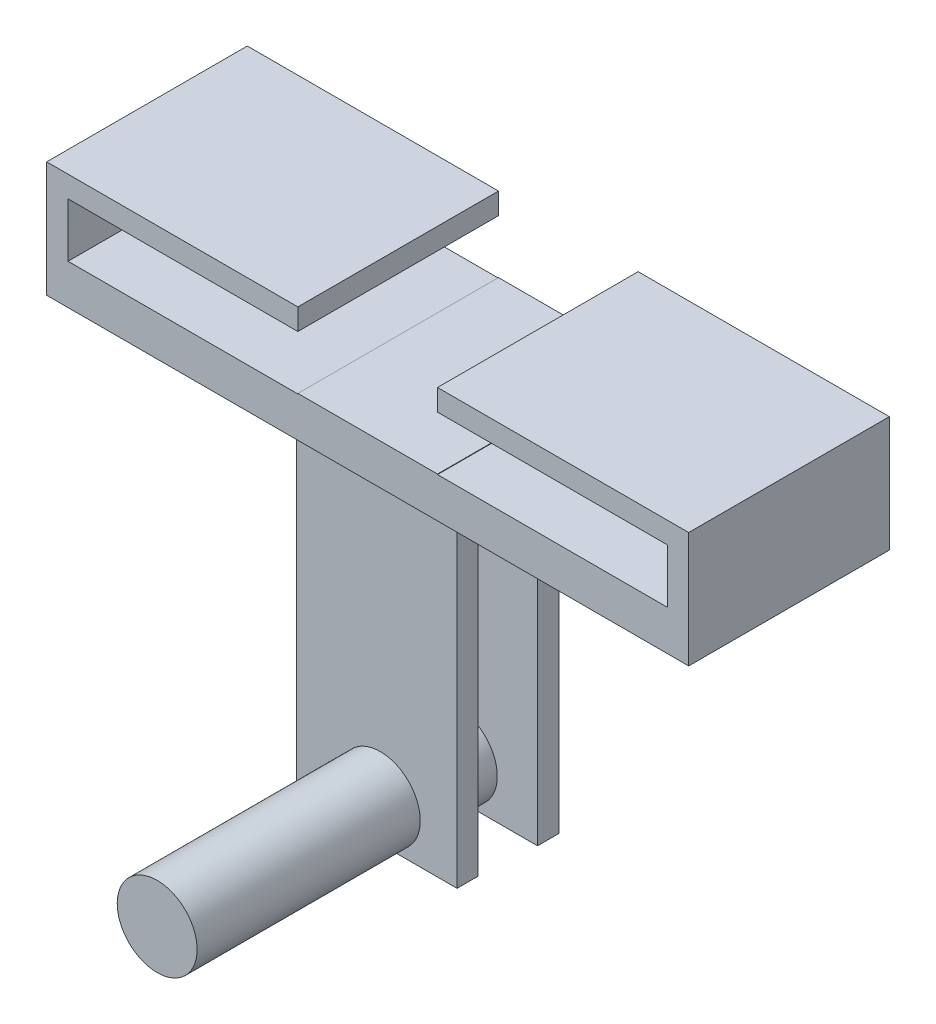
ISO-10303-21;
HEADER;
FILE_DESCRIPTION(('STEP AP214'),'2;1');
FILE_NAME('part.step','',(''),(''),'','','');
FILE_SCHEMA(('AUTOMOTIVE_DESIGN { 1 0 10303 214 1 1 1 1 }'));
ENDSEC;
DATA;
#1=APPLICATION_CONTEXT('core data for automotive mechanical design processes');
#2=APPLICATION_PROTOCOL_DEFINITION('international standard','automotive_design',2000,#1);
#3=PRODUCT_CONTEXT('',#1,'mechanical');
#4=PRODUCT('Part','Part','',(#3));
#5=PRODUCT_RELATED_PRODUCT_CATEGORY('part','',(#4));
#6=PRODUCT_DEFINITION_FORMATION('','',#4);
#7=PRODUCT_DEFINITION_CONTEXT('part definition',#1,'design');
#8=PRODUCT_DEFINITION('design','',#6,#7);
#9=PRODUCT_DEFINITION_SHAPE('','',#8);
#10=(LENGTH_UNIT() NAMED_UNIT(*) SI_UNIT(.MILLI.,.METRE.));
#11=(NAMED_UNIT(*) PLANE_ANGLE_UNIT() SI_UNIT($,.RADIAN.));
#12=(NAMED_UNIT(*) SI_UNIT($,.STERADIAN.) SOLID_ANGLE_UNIT());
#13=UNCERTAINTY_MEASURE_WITH_UNIT(LENGTH_MEASURE(1.E-05),#10,'distance_accuracy_value','');
#14=(GEOMETRIC_REPRESENTATION_CONTEXT(3) GLOBAL_UNCERTAINTY_ASSIGNED_CONTEXT((#13)) GLOBAL_UNIT_ASSIGNED_CONTEXT((#10,
#11,#12)) REPRESENTATION_CONTEXT('',''));
#15=CARTESIAN_POINT('',(0.,0.,0.));
#16=DIRECTION('',(0.,0.,1.));
#17=DIRECTION('',(1.,0.,0.));
#18=AXIS2_PLACEMENT_3D('',#15,#16,#17);
#19=CARTESIAN_POINT('',(0.,0.,0.));
#20=DIRECTION('',(0.,-1.,0.));
#21=DIRECTION('',(0.,0.,-1.));
#22=AXIS2_PLACEMENT_3D('',#19,#20,#21);
#23=PLANE('',#22);
#24=DIRECTION('',(0.,0.,-1.));
#25=VECTOR('',#24,1.);
#26=CARTESIAN_POINT('',(0.,0.,0.));
#27=LINE('',#26,#25);
#28=CARTESIAN_POINT('',(0.,0.,0.));
#29=VERTEX_POINT('',#28);
#30=CARTESIAN_POINT('',(0.,0.,-31.75));
#31=VERTEX_POINT('',#30);
#32=EDGE_CURVE('E357',#29,#31,#27,.T.);
#33=ORIENTED_EDGE('',*,*,#32,.T.);
#34=DIRECTION('',(1.,0.,0.));
#35=VECTOR('',#34,1.);
#36=CARTESIAN_POINT('',(0.,0.,-31.75));
#37=LINE('',#36,#35);
#38=CARTESIAN_POINT('',(101.6,0.,-31.75));
#39=VERTEX_POINT('',#38);
#40=EDGE_CURVE('E381',#31,#39,#37,.T.);
#41=ORIENTED_EDGE('',*,*,#40,.T.);
#42=DIRECTION('',(0.,0.,-1.));
#43=VECTOR('',#42,1.);
#44=CARTESIAN_POINT('',(101.6,0.,0.));
#45=LINE('',#44,#43);
#46=CARTESIAN_POINT('',(101.6,0.,0.));
#47=VERTEX_POINT('',#46);
#48=EDGE_CURVE('E384',#47,#39,#45,.T.);
#49=ORIENTED_EDGE('',*,*,#48,.F.);
#50=DIRECTION('',(1.,0.,0.));
#51=VECTOR('',#50,1.);
#52=CARTESIAN_POINT('',(0.,0.,0.));
#53=LINE('',#52,#51);
#54=EDGE_CURVE('E367',#29,#47,#53,.T.);
#55=ORIENTED_EDGE('',*,*,#54,.F.);
#56=EDGE_LOOP('',(#33,#41,#49,#55));
#57=FACE_BOUND('',#56,.T.);
#58=DIRECTION('',(-1.,0.,0.));
#59=VECTOR('',#58,1.);
#60=CARTESIAN_POINT('',(63.48984,0.,-14.1859));
#61=LINE('',#60,#59);
#62=CARTESIAN_POINT('',(63.48984,0.,-14.1859));
#63=VERTEX_POINT('',#62);
#64=CARTESIAN_POINT('',(38.11016,0.,-14.1859));
#65=VERTEX_POINT('',#64);
#66=EDGE_CURVE('E260',#63,#65,#61,.T.);
#67=ORIENTED_EDGE('',*,*,#66,.F.);
#68=DIRECTION('',(0.,0.,1.));
#69=VECTOR('',#68,1.);
#70=CARTESIAN_POINT('',(63.48984,0.,-17.5641));
#71=LINE('',#70,#69);
#72=CARTESIAN_POINT('',(63.48984,0.,-17.5641));
#73=VERTEX_POINT('',#72);
#74=EDGE_CURVE('E245',#73,#63,#71,.T.);
#75=ORIENTED_EDGE('',*,*,#74,.F.);
#76=DIRECTION('',(1.,0.,0.));
#77=VECTOR('',#76,1.);
#78=CARTESIAN_POINT('',(63.48984,0.,-17.5641));
#79=LINE('',#78,#77);
#80=CARTESIAN_POINT('',(38.11016,0.,-17.5641));
#81=VERTEX_POINT('',#80);
#82=EDGE_CURVE('E251',#81,#73,#79,.T.);
#83=ORIENTED_EDGE('',*,*,#82,.F.);
#84=DIRECTION('',(0.,0.,-1.));
#85=VECTOR('',#84,1.);
#86=CARTESIAN_POINT('',(38.11016,0.,-17.5641));
#87=LINE('',#86,#85);
#88=EDGE_CURVE('E262',#65,#81,#87,.T.);
#89=ORIENTED_EDGE('',*,*,#88,.F.);
#90=EDGE_LOOP('',(#67,#75,#83,#89));
#91=FACE_BOUND('',#90,.T.);
#92=DIRECTION('',(1.,0.,0.));
#93=VECTOR('',#92,1.);
#94=CARTESIAN_POINT('',(37.552154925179,0.,-5.2959));
#95=LINE('',#94,#93);
#96=CARTESIAN_POINT('',(37.552154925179,0.,-5.2959));
#97=VERTEX_POINT('',#96);
#98=CARTESIAN_POINT('',(62.952154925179,0.,-5.2959));
#99=VERTEX_POINT('',#98);
#100=EDGE_CURVE('E695',#97,#99,#95,.T.);
#101=ORIENTED_EDGE('',*,*,#100,.F.);
#102=DIRECTION('',(0.,0.,-1.));
#103=VECTOR('',#102,1.);
#104=CARTESIAN_POINT('',(37.552154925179,0.,-5.2959));
#105=LINE('',#104,#103);
#106=CARTESIAN_POINT('',(37.552154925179,0.,-1.9939));
#107=VERTEX_POINT('',#106);
#108=EDGE_CURVE('E234',#107,#97,#105,.T.);
#109=ORIENTED_EDGE('',*,*,#108,.F.);
#110=DIRECTION('',(-1.,0.,0.));
#111=VECTOR('',#110,1.);
#112=CARTESIAN_POINT('',(37.552154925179,0.,-1.9939));
#113=LINE('',#112,#111);
#114=CARTESIAN_POINT('',(62.952154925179,0.,-1.9939));
#115=VERTEX_POINT('',#114);
#116=EDGE_CURVE('E230',#115,#107,#113,.T.);
#117=ORIENTED_EDGE('',*,*,#116,.F.);
#118=DIRECTION('',(0.,0.,1.));
#119=VECTOR('',#118,1.);
#120=CARTESIAN_POINT('',(62.952154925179,0.,-5.2959));
#121=LINE('',#120,#119);
#122=EDGE_CURVE('E692',#99,#115,#121,.T.);
#123=ORIENTED_EDGE('',*,*,#122,.F.);
#124=EDGE_LOOP('',(#101,#109,#117,#123));
#125=FACE_BOUND('',#124,.T.);
#126=ADVANCED_FACE('F49',(#57,#91,#125),#23,.T.);
#127=CARTESIAN_POINT('',(50.8,-44.45,33.3121));
#128=DIRECTION('',(0.,0.,-1.));
#129=DIRECTION('',(-1.,0.,0.));
#130=AXIS2_PLACEMENT_3D('',#127,#128,#129);
#131=CYLINDRICAL_SURFACE('',#130,6.3246);
#132=CARTESIAN_POINT('',(50.8,-44.45,-14.1859));
#133=DIRECTION('',(0.,0.,1.));
#134=DIRECTION('',(1.,0.,0.));
#135=AXIS2_PLACEMENT_3D('',#132,#133,#134);
#136=CIRCLE('',#135,6.3246);
#137=CARTESIAN_POINT('',(44.4754,-44.45,-14.1859));
#138=VERTEX_POINT('',#137);
#139=EDGE_CURVE('E236',#138,#138,#136,.T.);
#140=CARTESIAN_POINT('',(50.8,-44.45,-5.2959));
#141=DIRECTION('',(0.,0.,1.));
#142=DIRECTION('',(1.,0.,0.));
#143=AXIS2_PLACEMENT_3D('',#140,#141,#142);
#144=CIRCLE('',#143,6.3246);
#145=CARTESIAN_POINT('',(44.4754,-44.45,-5.2959));
#146=VERTEX_POINT('',#145);
#147=EDGE_CURVE('E12',#146,#146,#144,.T.);
#148=CARTESIAN_POINT('',(44.4754,-44.45,-14.1859));
#149=CARTESIAN_POINT('',(44.4754,-44.45,-14.0932958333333));
#150=CARTESIAN_POINT('',(44.4754,-44.45,-14.0006916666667));
#151=CARTESIAN_POINT('',(44.4754,-44.45,-13.8154833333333));
#152=CARTESIAN_POINT('',(44.4754,-44.45,-13.7228791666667));
#153=CARTESIAN_POINT('',(44.4754,-44.45,-13.5376708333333));
#154=CARTESIAN_POINT('',(44.4754,-44.45,-13.4450666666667));
#155=CARTESIAN_POINT('',(44.4754,-44.45,-13.2598583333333));
#156=CARTESIAN_POINT('',(44.4754,-44.45,-13.1672541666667));
#157=CARTESIAN_POINT('',(44.4754,-44.45,-12.9820458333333));
#158=CARTESIAN_POINT('',(44.4754,-44.45,-12.8894416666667));
#159=CARTESIAN_POINT('',(44.4754,-44.45,-12.7042333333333));
#160=CARTESIAN_POINT('',(44.4754,-44.45,-12.6116291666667));
#161=CARTESIAN_POINT('',(44.4754,-44.45,-12.4264208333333));
#162=CARTESIAN_POINT('',(44.4754,-44.45,-12.3338166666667));
#163=CARTESIAN_POINT('',(44.4754,-44.45,-12.1486083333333));
#164=CARTESIAN_POINT('',(44.4754,-44.45,-12.0560041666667));
#165=CARTESIAN_POINT('',(44.4754,-44.45,-11.8707958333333));
#166=CARTESIAN_POINT('',(44.4754,-44.45,-11.7781916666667));
#167=CARTESIAN_POINT('',(44.4754,-44.45,-11.5929833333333));
#168=CARTESIAN_POINT('',(44.4754,-44.45,-11.5003791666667));
#169=CARTESIAN_POINT('',(44.4754,-44.45,-11.3151708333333));
#170=CARTESIAN_POINT('',(44.4754,-44.45,-11.2225666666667));
#171=CARTESIAN_POINT('',(44.4754,-44.45,-11.0373583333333));
#172=CARTESIAN_POINT('',(44.4754,-44.45,-10.9447541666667));
#173=CARTESIAN_POINT('',(44.4754,-44.45,-10.7595458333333));
#174=CARTESIAN_POINT('',(44.4754,-44.45,-10.6669416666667));
#175=CARTESIAN_POINT('',(44.4754,-44.45,-10.4817333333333));
#176=CARTESIAN_POINT('',(44.4754,-44.45,-10.3891291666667));
#177=CARTESIAN_POINT('',(44.4754,-44.45,-10.2039208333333));
#178=CARTESIAN_POINT('',(44.4754,-44.45,-10.1113166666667));
#179=CARTESIAN_POINT('',(44.4754,-44.45,-9.92610833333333));
#180=CARTESIAN_POINT('',(44.4754,-44.45,-9.83350416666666));
#181=CARTESIAN_POINT('',(44.4754,-44.45,-9.64829583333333));
#182=CARTESIAN_POINT('',(44.4754,-44.45,-9.55569166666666));
#183=CARTESIAN_POINT('',(44.4754,-44.45,-9.37048333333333));
#184=CARTESIAN_POINT('',(44.4754,-44.45,-9.27787916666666));
#185=CARTESIAN_POINT('',(44.4754,-44.45,-9.09267083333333));
#186=CARTESIAN_POINT('',(44.4754,-44.45,-9.00006666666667));
#187=CARTESIAN_POINT('',(44.4754,-44.45,-8.81485833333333));
#188=CARTESIAN_POINT('',(44.4754,-44.45,-8.72225416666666));
#189=CARTESIAN_POINT('',(44.4754,-44.45,-8.53704583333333));
#190=CARTESIAN_POINT('',(44.4754,-44.45,-8.44444166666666));
#191=CARTESIAN_POINT('',(44.4754,-44.45,-8.25923333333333));
#192=CARTESIAN_POINT('',(44.4754,-44.45,-8.16662916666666));
#193=CARTESIAN_POINT('',(44.4754,-44.45,-7.98142083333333));
#194=CARTESIAN_POINT('',(44.4754,-44.45,-7.88881666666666));
#195=CARTESIAN_POINT('',(44.4754,-44.45,-7.70360833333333));
#196=CARTESIAN_POINT('',(44.4754,-44.45,-7.61100416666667));
#197=CARTESIAN_POINT('',(44.4754,-44.45,-7.42579583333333));
#198=CARTESIAN_POINT('',(44.4754,-44.45,-7.33319166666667));
#199=CARTESIAN_POINT('',(44.4754,-44.45,-7.14798333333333));
#200=CARTESIAN_POINT('',(44.4754,-44.45,-7.05537916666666));
#201=CARTESIAN_POINT('',(44.4754,-44.45,-6.87017083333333));
#202=CARTESIAN_POINT('',(44.4754,-44.45,-6.77756666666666));
#203=CARTESIAN_POINT('',(44.4754,-44.45,-6.59235833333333));
#204=CARTESIAN_POINT('',(44.4754,-44.45,-6.49975416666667));
#205=CARTESIAN_POINT('',(44.4754,-44.45,-6.31454583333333));
#206=CARTESIAN_POINT('',(44.4754,-44.45,-6.22194166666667));
#207=CARTESIAN_POINT('',(44.4754,-44.45,-6.03673333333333));
#208=CARTESIAN_POINT('',(44.4754,-44.45,-5.94412916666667));
#209=CARTESIAN_POINT('',(44.4754,-44.45,-5.75892083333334));
#210=CARTESIAN_POINT('',(44.4754,-44.45,-5.66631666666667));
#211=CARTESIAN_POINT('',(44.4754,-44.45,-5.48110833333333));
#212=CARTESIAN_POINT('',(44.4754,-44.45,-5.38850416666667));
#213=CARTESIAN_POINT('',(44.4754,-44.45,-5.2959));
#214=B_SPLINE_CURVE_WITH_KNOTS('',3,(#148,#149,#150,#151,#152,#153,#154,#155,#156,#157,#158,
#159,#160,#161,#162,#163,#164,#165,#166,#167,#168,#169,#170,#171,#172,#173,#174,#175,#176,#177,
#178,#179,#180,#181,#182,#183,#184,#185,#186,#187,#188,#189,#190,#191,#192,#193,#194,#195,#196,
#197,#198,#199,#200,#201,#202,#203,#204,#205,#206,#207,#208,#209,#210,#211,#212,#213),
.UNSPECIFIED.,.F.,.F.,(4,2,2,2,2,2,2,2,2,2,2,2,2,2,2,2,2,2,2,2,2,2,2,2,2,2,2,2,2,2,2,2,4),(0.,
0.277812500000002,0.555624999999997,0.833437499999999,1.11125,1.3890625,1.666875,1.9446875,
2.2225,2.5003125,2.778125,3.0559375,3.33375,3.6115625,3.889375,4.1671875,4.445,4.7228125,
5.00062499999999,5.2784375,5.55625,5.8340625,6.111875,6.3896875,6.66749999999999,
6.94531249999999,7.223125,7.5009375,7.77874999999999,8.0565625,8.33437499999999,
8.61218749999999,8.89),.UNSPECIFIED.);
#215=EDGE_CURVE('BSEAM405',#138,#146,#214,.T.);
#216=ORIENTED_EDGE('',*,*,#139,.T.);
#217=ORIENTED_EDGE('',*,*,#147,.F.);
#218=ORIENTED_EDGE('',*,*,#215,.T.);
#219=ORIENTED_EDGE('',*,*,#215,.F.);
#220=EDGE_LOOP('',(#216,#218,#217,#219));
#221=FACE_BOUND('',#220,.T.);
#222=ADVANCED_FACE('F405',(#221),#131,.T.);
#223=CARTESIAN_POINT('',(63.48984,-50.8,-14.1859));
#224=DIRECTION('',(0.,0.,-1.));
#225=DIRECTION('',(-1.,0.,0.));
#226=AXIS2_PLACEMENT_3D('',#223,#224,#225);
#227=PLANE('',#226);
#228=ORIENTED_EDGE('',*,*,#66,.T.);
#229=DIRECTION('',(0.,1.,0.));
#230=VECTOR('',#229,1.);
#231=CARTESIAN_POINT('',(38.11016,-50.8,-14.1859));
#232=LINE('',#231,#230);
#233=CARTESIAN_POINT('',(38.11016,-50.8,-14.1859));
#234=VERTEX_POINT('',#233);
#235=EDGE_CURVE('E268',#234,#65,#232,.T.);
#236=ORIENTED_EDGE('',*,*,#235,.F.);
#237=DIRECTION('',(-1.,0.,0.));
#238=VECTOR('',#237,1.);
#239=CARTESIAN_POINT('',(63.48984,-50.8,-14.1859));
#240=LINE('',#239,#238);
#241=CARTESIAN_POINT('',(63.48984,-50.8,-14.1859));
#242=VERTEX_POINT('',#241);
#243=EDGE_CURVE('E250',#242,#234,#240,.T.);
#244=ORIENTED_EDGE('',*,*,#243,.F.);
#245=DIRECTION('',(0.,1.,0.));
#246=VECTOR('',#245,1.);
#247=CARTESIAN_POINT('',(63.48984,-50.8,-14.1859));
#248=LINE('',#247,#246);
#249=EDGE_CURVE('E271',#242,#63,#248,.T.);
#250=ORIENTED_EDGE('',*,*,#249,.T.);
#251=EDGE_LOOP('',(#228,#236,#244,#250));
#252=FACE_BOUND('',#251,.T.);
#253=ORIENTED_EDGE('',*,*,#139,.F.);
#254=EDGE_LOOP('',(#253));
#255=FACE_BOUND('',#254,.T.);
#256=ADVANCED_FACE('F415',(#252,#255),#227,.F.);
#257=CARTESIAN_POINT('',(0.,18.288,0.));
#258=DIRECTION('',(0.,-1.,0.));
#259=DIRECTION('',(0.,0.,-1.));
#260=AXIS2_PLACEMENT_3D('',#257,#258,#259);
#261=PLANE('',#260);
#262=DIRECTION('',(1.,0.,0.));
#263=VECTOR('',#262,1.);
#264=CARTESIAN_POINT('',(0.,18.288,-31.75));
#265=LINE('',#264,#263);
#266=CARTESIAN_POINT('',(61.849,18.288,-31.75));
#267=VERTEX_POINT('',#266);
#268=CARTESIAN_POINT('',(101.6,18.288,-31.75));
#269=VERTEX_POINT('',#268);
#270=EDGE_CURVE('E366',#267,#269,#265,.T.);
#271=ORIENTED_EDGE('',*,*,#270,.F.);
#272=DIRECTION('',(0.,0.,-1.));
#273=VECTOR('',#272,1.);
#274=CARTESIAN_POINT('',(61.849,18.288,-31.75));
#275=LINE('',#274,#273);
#276=CARTESIAN_POINT('',(61.849,18.288,0.));
#277=VERTEX_POINT('',#276);
#278=EDGE_CURVE('E341',#277,#267,#275,.T.);
#279=ORIENTED_EDGE('',*,*,#278,.F.);
#280=DIRECTION('',(1.,0.,0.));
#281=VECTOR('',#280,1.);
#282=CARTESIAN_POINT('',(0.,18.288,0.));
#283=LINE('',#282,#281);
#284=CARTESIAN_POINT('',(101.6,18.288,0.));
#285=VERTEX_POINT('',#284);
#286=EDGE_CURVE('E374',#277,#285,#283,.T.);
#287=ORIENTED_EDGE('',*,*,#286,.T.);
#288=DIRECTION('',(0.,0.,-1.));
#289=VECTOR('',#288,1.);
#290=CARTESIAN_POINT('',(101.6,18.288,0.));
#291=LINE('',#290,#289);
#292=EDGE_CURVE('E371',#285,#269,#291,.T.);
#293=ORIENTED_EDGE('',*,*,#292,.T.);
#294=EDGE_LOOP('',(#271,#279,#287,#293));
#295=FACE_BOUND('',#294,.T.);
#296=ADVANCED_FACE('F443',(#295),#261,.F.);
#297=CARTESIAN_POINT('',(0.,18.288,0.));
#298=DIRECTION('',(-1.,0.,0.));
#299=DIRECTION('',(0.,0.,1.));
#300=AXIS2_PLACEMENT_3D('',#297,#298,#299);
#301=PLANE('',#300);
#302=ORIENTED_EDGE('',*,*,#32,.F.);
#303=DIRECTION('',(0.,-1.,0.));
#304=VECTOR('',#303,1.);
#305=CARTESIAN_POINT('',(0.,18.288,0.));
#306=LINE('',#305,#304);
#307=CARTESIAN_POINT('',(0.,18.288,0.));
#308=VERTEX_POINT('',#307);
#309=EDGE_CURVE('E388',#308,#29,#306,.T.);
#310=ORIENTED_EDGE('',*,*,#309,.F.);
#311=DIRECTION('',(0.,0.,-1.));
#312=VECTOR('',#311,1.);
#313=CARTESIAN_POINT('',(0.,18.288,0.));
#314=LINE('',#313,#312);
#315=CARTESIAN_POINT('',(0.,18.288,-31.75));
#316=VERTEX_POINT('',#315);
#317=EDGE_CURVE('E363',#308,#316,#314,.T.);
#318=ORIENTED_EDGE('',*,*,#317,.T.);
#319=DIRECTION('',(0.,-1.,0.));
#320=VECTOR('',#319,1.);
#321=CARTESIAN_POINT('',(0.,18.288,-31.75));
#322=LINE('',#321,#320);
#323=EDGE_CURVE('E378',#316,#31,#322,.T.);
#324=ORIENTED_EDGE('',*,*,#323,.T.);
#325=EDGE_LOOP('',(#302,#310,#318,#324));
#326=FACE_BOUND('',#325,.T.);
#327=ADVANCED_FACE('F51',(#326),#301,.T.);
#328=CARTESIAN_POINT('',(0.,18.288,0.));
#329=DIRECTION('',(0.,0.,-1.));
#330=DIRECTION('',(-1.,0.,0.));
#331=AXIS2_PLACEMENT_3D('',#328,#329,#330);
#332=PLANE('',#331);
#333=DIRECTION('',(0.,-1.,0.));
#334=VECTOR('',#333,1.);
#335=CARTESIAN_POINT('',(3.37820000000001,6.35,0.));
#336=LINE('',#335,#334);
#337=CARTESIAN_POINT('',(3.37820000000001,14.9098,0.));
#338=VERTEX_POINT('',#337);
#339=CARTESIAN_POINT('',(3.37820000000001,6.35,0.));
#340=VERTEX_POINT('',#339);
#341=EDGE_CURVE('E278',#338,#340,#336,.T.);
#342=ORIENTED_EDGE('',*,*,#341,.F.);
#343=DIRECTION('',(-1.,0.,0.));
#344=VECTOR('',#343,1.);
#345=CARTESIAN_POINT('',(39.751,14.9098,0.));
#346=LINE('',#345,#344);
#347=CARTESIAN_POINT('',(39.751,14.9098,0.));
#348=VERTEX_POINT('',#347);
#349=EDGE_CURVE('E294',#348,#338,#346,.T.);
#350=ORIENTED_EDGE('',*,*,#349,.F.);
#351=DIRECTION('',(0.,1.,0.));
#352=VECTOR('',#351,1.);
#353=CARTESIAN_POINT('',(39.751,6.4262,0.));
#354=LINE('',#353,#352);
#355=CARTESIAN_POINT('',(39.751,18.288,0.));
#356=VERTEX_POINT('',#355);
#357=EDGE_CURVE('E360',#348,#356,#354,.T.);
#358=ORIENTED_EDGE('',*,*,#357,.T.);
#359=EDGE_CURVE('E375',#308,#356,#283,.T.);
#360=ORIENTED_EDGE('',*,*,#359,.F.);
#361=ORIENTED_EDGE('',*,*,#309,.T.);
#362=ORIENTED_EDGE('',*,*,#54,.T.);
#363=DIRECTION('',(0.,-1.,0.));
#364=VECTOR('',#363,1.);
#365=CARTESIAN_POINT('',(101.6,18.288,0.));
#366=LINE('',#365,#364);
#367=EDGE_CURVE('E390',#285,#47,#366,.T.);
#368=ORIENTED_EDGE('',*,*,#367,.F.);
#369=ORIENTED_EDGE('',*,*,#286,.F.);
#370=DIRECTION('',(0.,1.,0.));
#371=VECTOR('',#370,1.);
#372=CARTESIAN_POINT('',(61.849,6.4262,0.));
#373=LINE('',#372,#371);
#374=CARTESIAN_POINT('',(61.849,14.9098,0.));
#375=VERTEX_POINT('',#374);
#376=EDGE_CURVE('E358',#375,#277,#373,.T.);
#377=ORIENTED_EDGE('',*,*,#376,.F.);
#378=DIRECTION('',(-1.,0.,0.));
#379=VECTOR('',#378,1.);
#380=CARTESIAN_POINT('',(61.849,14.9098,0.));
#381=LINE('',#380,#379);
#382=CARTESIAN_POINT('',(98.2218,14.9098,0.));
#383=VERTEX_POINT('',#382);
#384=EDGE_CURVE('E317',#383,#375,#381,.T.);
#385=ORIENTED_EDGE('',*,*,#384,.F.);
#386=DIRECTION('',(0.,1.,0.));
#387=VECTOR('',#386,1.);
#388=CARTESIAN_POINT('',(98.2218,6.35,0.));
#389=LINE('',#388,#387);
#390=CARTESIAN_POINT('',(98.2218,6.35,0.));
#391=VERTEX_POINT('',#390);
#392=EDGE_CURVE('E319',#391,#383,#389,.T.);
#393=ORIENTED_EDGE('',*,*,#392,.F.);
#394=DIRECTION('',(1.,0.,0.));
#395=VECTOR('',#394,1.);
#396=CARTESIAN_POINT('',(61.849,6.35,0.));
#397=LINE('',#396,#395);
#398=CARTESIAN_POINT('',(61.849,6.35,0.));
#399=VERTEX_POINT('',#398);
#400=EDGE_CURVE('E323',#399,#391,#397,.T.);
#401=ORIENTED_EDGE('',*,*,#400,.F.);
#402=DIRECTION('',(0.,-1.,0.));
#403=VECTOR('',#402,1.);
#404=CARTESIAN_POINT('',(61.849,6.35,0.));
#405=LINE('',#404,#403);
#406=CARTESIAN_POINT('',(61.849,6.4262,0.));
#407=VERTEX_POINT('',#406);
#408=EDGE_CURVE('E292',#407,#399,#405,.T.);
#409=ORIENTED_EDGE('',*,*,#408,.F.);
#410=DIRECTION('',(1.,0.,0.));
#411=VECTOR('',#410,1.);
#412=CARTESIAN_POINT('',(39.751,6.4262,0.));
#413=LINE('',#412,#411);
#414=CARTESIAN_POINT('',(39.751,6.4262,0.));
#415=VERTEX_POINT('',#414);
#416=EDGE_CURVE('E344',#415,#407,#413,.T.);
#417=ORIENTED_EDGE('',*,*,#416,.F.);
#418=DIRECTION('',(0.,1.,0.));
#419=VECTOR('',#418,1.);
#420=CARTESIAN_POINT('',(39.751,6.35,0.));
#421=LINE('',#420,#419);
#422=CARTESIAN_POINT('',(39.751,6.35,0.));
#423=VERTEX_POINT('',#422);
#424=EDGE_CURVE('E291',#423,#415,#421,.T.);
#425=ORIENTED_EDGE('',*,*,#424,.F.);
#426=DIRECTION('',(1.,0.,0.));
#427=VECTOR('',#426,1.);
#428=CARTESIAN_POINT('',(39.751,6.35,0.));
#429=LINE('',#428,#427);
#430=EDGE_CURVE('E288',#340,#423,#429,.T.);
#431=ORIENTED_EDGE('',*,*,#430,.F.);
#432=EDGE_LOOP('',(#342,#350,#358,#360,#361,#362,#368,#369,#377,#385,#393,#401,#409,#417,#425,#431));
#433=FACE_BOUND('',#432,.T.);
#434=ADVANCED_FACE('F427',(#433),#332,.F.);
#435=CARTESIAN_POINT('',(101.6,18.288,0.));
#436=DIRECTION('',(-1.,0.,0.));
#437=DIRECTION('',(0.,0.,1.));
#438=AXIS2_PLACEMENT_3D('',#435,#436,#437);
#439=PLANE('',#438);
#440=ORIENTED_EDGE('',*,*,#48,.T.);
#441=DIRECTION('',(0.,-1.,0.));
#442=VECTOR('',#441,1.);
#443=CARTESIAN_POINT('',(101.6,18.288,-31.75));
#444=LINE('',#443,#442);
#445=EDGE_CURVE('E393',#269,#39,#444,.T.);
#446=ORIENTED_EDGE('',*,*,#445,.F.);
#447=ORIENTED_EDGE('',*,*,#292,.F.);
#448=ORIENTED_EDGE('',*,*,#367,.T.);
#449=EDGE_LOOP('',(#440,#446,#447,#448));
#450=FACE_BOUND('',#449,.T.);
#451=ADVANCED_FACE('F430',(#450),#439,.F.);
#452=CARTESIAN_POINT('',(0.,18.288,-31.75));
#453=DIRECTION('',(0.,0.,-1.));
#454=DIRECTION('',(-1.,0.,0.));
#455=AXIS2_PLACEMENT_3D('',#452,#453,#454);
#456=PLANE('',#455);
#457=DIRECTION('',(-1.,0.,0.));
#458=VECTOR('',#457,1.);
#459=CARTESIAN_POINT('',(39.751,14.9098,-31.75));
#460=LINE('',#459,#458);
#461=CARTESIAN_POINT('',(39.751,14.9098,-31.75));
#462=VERTEX_POINT('',#461);
#463=CARTESIAN_POINT('',(3.37820000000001,14.9098,-31.75));
#464=VERTEX_POINT('',#463);
#465=EDGE_CURVE('E281',#462,#464,#460,.T.);
#466=ORIENTED_EDGE('',*,*,#465,.T.);
#467=DIRECTION('',(0.,-1.,0.));
#468=VECTOR('',#467,1.);
#469=CARTESIAN_POINT('',(3.37820000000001,6.35,-31.75));
#470=LINE('',#469,#468);
#471=CARTESIAN_POINT('',(3.37820000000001,6.35,-31.75));
#472=VERTEX_POINT('',#471);
#473=EDGE_CURVE('E284',#464,#472,#470,.T.);
#474=ORIENTED_EDGE('',*,*,#473,.T.);
#475=DIRECTION('',(1.,0.,0.));
#476=VECTOR('',#475,1.);
#477=CARTESIAN_POINT('',(39.751,6.35,-31.75));
#478=LINE('',#477,#476);
#479=CARTESIAN_POINT('',(39.751,6.35,-31.75));
#480=VERTEX_POINT('',#479);
#481=EDGE_CURVE('E274',#472,#480,#478,.T.);
#482=ORIENTED_EDGE('',*,*,#481,.T.);
#483=DIRECTION('',(0.,1.,0.));
#484=VECTOR('',#483,1.);
#485=CARTESIAN_POINT('',(39.751,6.35,-31.75));
#486=LINE('',#485,#484);
#487=CARTESIAN_POINT('',(39.751,6.4262,-31.75));
#488=VERTEX_POINT('',#487);
#489=EDGE_CURVE('E277',#480,#488,#486,.T.);
#490=ORIENTED_EDGE('',*,*,#489,.T.);
#491=DIRECTION('',(-1.,0.,0.));
#492=VECTOR('',#491,1.);
#493=CARTESIAN_POINT('',(39.751,6.4262,-31.75));
#494=LINE('',#493,#492);
#495=CARTESIAN_POINT('',(61.849,6.4262,-31.75));
#496=VERTEX_POINT('',#495);
#497=EDGE_CURVE('E337',#496,#488,#494,.T.);
#498=ORIENTED_EDGE('',*,*,#497,.F.);
#499=DIRECTION('',(0.,-1.,0.));
#500=VECTOR('',#499,1.);
#501=CARTESIAN_POINT('',(61.849,6.35,-31.75));
#502=LINE('',#501,#500);
#503=CARTESIAN_POINT('',(61.849,6.35,-31.75));
#504=VERTEX_POINT('',#503);
#505=EDGE_CURVE('E320',#496,#504,#502,.T.);
#506=ORIENTED_EDGE('',*,*,#505,.T.);
#507=DIRECTION('',(1.,0.,0.));
#508=VECTOR('',#507,1.);
#509=CARTESIAN_POINT('',(61.849,6.35,-31.75));
#510=LINE('',#509,#508);
#511=CARTESIAN_POINT('',(98.2218,6.35,-31.75));
#512=VERTEX_POINT('',#511);
#513=EDGE_CURVE('E332',#504,#512,#510,.T.);
#514=ORIENTED_EDGE('',*,*,#513,.T.);
#515=DIRECTION('',(0.,1.,0.));
#516=VECTOR('',#515,1.);
#517=CARTESIAN_POINT('',(98.2218,6.35,-31.75));
#518=LINE('',#517,#516);
#519=CARTESIAN_POINT('',(98.2218,14.9098,-31.75));
#520=VERTEX_POINT('',#519);
#521=EDGE_CURVE('E329',#512,#520,#518,.T.);
#522=ORIENTED_EDGE('',*,*,#521,.T.);
#523=DIRECTION('',(-1.,0.,0.));
#524=VECTOR('',#523,1.);
#525=CARTESIAN_POINT('',(61.849,14.9098,-31.75));
#526=LINE('',#525,#524);
#527=CARTESIAN_POINT('',(61.849,14.9098,-31.75));
#528=VERTEX_POINT('',#527);
#529=EDGE_CURVE('E310',#520,#528,#526,.T.);
#530=ORIENTED_EDGE('',*,*,#529,.T.);
#531=DIRECTION('',(0.,1.,0.));
#532=VECTOR('',#531,1.);
#533=CARTESIAN_POINT('',(61.849,6.4262,-31.75));
#534=LINE('',#533,#532);
#535=EDGE_CURVE('E355',#528,#267,#534,.T.);
#536=ORIENTED_EDGE('',*,*,#535,.T.);
#537=ORIENTED_EDGE('',*,*,#270,.T.);
#538=ORIENTED_EDGE('',*,*,#445,.T.);
#539=ORIENTED_EDGE('',*,*,#40,.F.);
#540=ORIENTED_EDGE('',*,*,#323,.F.);
#541=CARTESIAN_POINT('',(39.751,18.288,-31.75));
#542=VERTEX_POINT('',#541);
#543=EDGE_CURVE('E368',#316,#542,#265,.T.);
#544=ORIENTED_EDGE('',*,*,#543,.T.);
#545=DIRECTION('',(0.,1.,0.));
#546=VECTOR('',#545,1.);
#547=CARTESIAN_POINT('',(39.751,6.4262,-31.75));
#548=LINE('',#547,#546);
#549=EDGE_CURVE('E350',#462,#542,#548,.T.);
#550=ORIENTED_EDGE('',*,*,#549,.F.);
#551=EDGE_LOOP('',(#466,#474,#482,#490,#498,#506,#514,#522,#530,#536,#537,#538,#539,#540,#544,#550));
#552=FACE_BOUND('',#551,.T.);
#553=ADVANCED_FACE('F433',(#552),#456,.T.);
#554=ORIENTED_EDGE('',*,*,#359,.T.);
#555=DIRECTION('',(0.,0.,1.));
#556=VECTOR('',#555,1.);
#557=CARTESIAN_POINT('',(39.751,18.288,0.));
#558=LINE('',#557,#556);
#559=EDGE_CURVE('E301',#542,#356,#558,.T.);
#560=ORIENTED_EDGE('',*,*,#559,.F.);
#561=ORIENTED_EDGE('',*,*,#543,.F.);
#562=ORIENTED_EDGE('',*,*,#317,.F.);
#563=EDGE_LOOP('',(#554,#560,#561,#562));
#564=FACE_BOUND('',#563,.T.);
#565=ADVANCED_FACE('F425',(#564),#261,.F.);
#566=CARTESIAN_POINT('',(61.849,6.4262,-31.75));
#567=DIRECTION('',(1.,0.,0.));
#568=DIRECTION('',(0.,0.,-1.));
#569=AXIS2_PLACEMENT_3D('',#566,#567,#568);
#570=PLANE('',#569);
#571=ORIENTED_EDGE('',*,*,#535,.F.);
#572=DIRECTION('',(0.,0.,1.));
#573=VECTOR('',#572,1.);
#574=CARTESIAN_POINT('',(61.849,14.9098,-31.75));
#575=LINE('',#574,#573);
#576=EDGE_CURVE('E273',#528,#375,#575,.T.);
#577=ORIENTED_EDGE('',*,*,#576,.T.);
#578=ORIENTED_EDGE('',*,*,#376,.T.);
#579=ORIENTED_EDGE('',*,*,#278,.T.);
#580=EDGE_LOOP('',(#571,#577,#578,#579));
#581=FACE_BOUND('',#580,.T.);
#582=ADVANCED_FACE('F441',(#581),#570,.F.);
#583=CARTESIAN_POINT('',(39.751,6.4262,0.));
#584=DIRECTION('',(-1.,0.,0.));
#585=DIRECTION('',(0.,0.,1.));
#586=AXIS2_PLACEMENT_3D('',#583,#584,#585);
#587=PLANE('',#586);
#588=ORIENTED_EDGE('',*,*,#357,.F.);
#589=DIRECTION('',(0.,0.,1.));
#590=VECTOR('',#589,1.);
#591=CARTESIAN_POINT('',(39.751,14.9098,-31.75));
#592=LINE('',#591,#590);
#593=EDGE_CURVE('E304',#462,#348,#592,.T.);
#594=ORIENTED_EDGE('',*,*,#593,.F.);
#595=ORIENTED_EDGE('',*,*,#549,.T.);
#596=ORIENTED_EDGE('',*,*,#559,.T.);
#597=EDGE_LOOP('',(#588,#594,#595,#596));
#598=FACE_BOUND('',#597,.T.);
#599=ADVANCED_FACE('F452',(#598),#587,.F.);
#600=CARTESIAN_POINT('',(0.,6.4262,0.));
#601=DIRECTION('',(0.,-1.,0.));
#602=DIRECTION('',(0.,0.,-1.));
#603=AXIS2_PLACEMENT_3D('',#600,#601,#602);
#604=PLANE('',#603);
#605=ORIENTED_EDGE('',*,*,#497,.T.);
#606=DIRECTION('',(0.,0.,1.));
#607=VECTOR('',#606,1.);
#608=CARTESIAN_POINT('',(39.751,6.4262,0.));
#609=LINE('',#608,#607);
#610=EDGE_CURVE('E340',#488,#415,#609,.T.);
#611=ORIENTED_EDGE('',*,*,#610,.T.);
#612=ORIENTED_EDGE('',*,*,#416,.T.);
#613=DIRECTION('',(0.,0.,-1.));
#614=VECTOR('',#613,1.);
#615=CARTESIAN_POINT('',(61.849,6.4262,-31.75));
#616=LINE('',#615,#614);
#617=EDGE_CURVE('E347',#407,#496,#616,.T.);
#618=ORIENTED_EDGE('',*,*,#617,.T.);
#619=EDGE_LOOP('',(#605,#611,#612,#618));
#620=FACE_BOUND('',#619,.T.);
#621=ADVANCED_FACE('F468',(#620),#604,.F.);
#622=CARTESIAN_POINT('',(61.849,6.35,-31.75));
#623=DIRECTION('',(-1.,0.,0.));
#624=DIRECTION('',(0.,0.,1.));
#625=AXIS2_PLACEMENT_3D('',#622,#623,#624);
#626=PLANE('',#625);
#627=ORIENTED_EDGE('',*,*,#408,.T.);
#628=DIRECTION('',(0.,0.,1.));
#629=VECTOR('',#628,1.);
#630=CARTESIAN_POINT('',(61.849,6.35,-31.75));
#631=LINE('',#630,#629);
#632=EDGE_CURVE('E307',#504,#399,#631,.T.);
#633=ORIENTED_EDGE('',*,*,#632,.F.);
#634=ORIENTED_EDGE('',*,*,#505,.F.);
#635=ORIENTED_EDGE('',*,*,#617,.F.);
#636=EDGE_LOOP('',(#627,#633,#634,#635));
#637=FACE_BOUND('',#636,.T.);
#638=ADVANCED_FACE('F472',(#637),#626,.F.);
#639=CARTESIAN_POINT('',(61.849,14.9098,-31.75));
#640=DIRECTION('',(0.,1.,0.));
#641=DIRECTION('',(-1.,0.,0.));
#642=AXIS2_PLACEMENT_3D('',#639,#640,#641);
#643=PLANE('',#642);
#644=ORIENTED_EDGE('',*,*,#384,.T.);
#645=ORIENTED_EDGE('',*,*,#576,.F.);
#646=ORIENTED_EDGE('',*,*,#529,.F.);
#647=DIRECTION('',(0.,0.,1.));
#648=VECTOR('',#647,1.);
#649=CARTESIAN_POINT('',(98.2218,14.9098,-31.75));
#650=LINE('',#649,#648);
#651=EDGE_CURVE('E313',#520,#383,#650,.T.);
#652=ORIENTED_EDGE('',*,*,#651,.T.);
#653=EDGE_LOOP('',(#644,#645,#646,#652));
#654=FACE_BOUND('',#653,.T.);
#655=ADVANCED_FACE('F485',(#654),#643,.F.);
#656=CARTESIAN_POINT('',(98.2218,6.35,-31.75));
#657=DIRECTION('',(1.,0.,0.));
#658=DIRECTION('',(0.,0.,-1.));
#659=AXIS2_PLACEMENT_3D('',#656,#657,#658);
#660=PLANE('',#659);
#661=ORIENTED_EDGE('',*,*,#392,.T.);
#662=ORIENTED_EDGE('',*,*,#651,.F.);
#663=ORIENTED_EDGE('',*,*,#521,.F.);
#664=DIRECTION('',(0.,0.,1.));
#665=VECTOR('',#664,1.);
#666=CARTESIAN_POINT('',(98.2218,6.35,-31.75));
#667=LINE('',#666,#665);
#668=EDGE_CURVE('E311',#512,#391,#667,.T.);
#669=ORIENTED_EDGE('',*,*,#668,.T.);
#670=EDGE_LOOP('',(#661,#662,#663,#669));
#671=FACE_BOUND('',#670,.T.);
#672=ADVANCED_FACE('F483',(#671),#660,.F.);
#673=CARTESIAN_POINT('',(61.849,6.35,-31.75));
#674=DIRECTION('',(0.,-1.,0.));
#675=DIRECTION('',(0.,0.,-1.));
#676=AXIS2_PLACEMENT_3D('',#673,#674,#675);
#677=PLANE('',#676);
#678=ORIENTED_EDGE('',*,*,#400,.T.);
#679=ORIENTED_EDGE('',*,*,#668,.F.);
#680=ORIENTED_EDGE('',*,*,#513,.F.);
#681=ORIENTED_EDGE('',*,*,#632,.T.);
#682=EDGE_LOOP('',(#678,#679,#680,#681));
#683=FACE_BOUND('',#682,.T.);
#684=ADVANCED_FACE('F477',(#683),#677,.F.);
#685=CARTESIAN_POINT('',(39.751,6.35,-31.75));
#686=DIRECTION('',(1.,0.,0.));
#687=DIRECTION('',(0.,0.,-1.));
#688=AXIS2_PLACEMENT_3D('',#685,#686,#687);
#689=PLANE('',#688);
#690=ORIENTED_EDGE('',*,*,#489,.F.);
#691=DIRECTION('',(0.,0.,1.));
#692=VECTOR('',#691,1.);
#693=CARTESIAN_POINT('',(39.751,6.35,-31.75));
#694=LINE('',#693,#692);
#695=EDGE_CURVE('E287',#480,#423,#694,.T.);
#696=ORIENTED_EDGE('',*,*,#695,.T.);
#697=ORIENTED_EDGE('',*,*,#424,.T.);
#698=ORIENTED_EDGE('',*,*,#610,.F.);
#699=EDGE_LOOP('',(#690,#696,#697,#698));
#700=FACE_BOUND('',#699,.T.);
#701=ADVANCED_FACE('F526',(#700),#689,.F.);
#702=CARTESIAN_POINT('',(39.751,6.35,-31.75));
#703=DIRECTION('',(0.,-1.,0.));
#704=DIRECTION('',(0.,0.,-1.));
#705=AXIS2_PLACEMENT_3D('',#702,#703,#704);
#706=PLANE('',#705);
#707=ORIENTED_EDGE('',*,*,#430,.T.);
#708=ORIENTED_EDGE('',*,*,#695,.F.);
#709=ORIENTED_EDGE('',*,*,#481,.F.);
#710=DIRECTION('',(0.,0.,1.));
#711=VECTOR('',#710,1.);
#712=CARTESIAN_POINT('',(3.37820000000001,6.35,-31.75));
#713=LINE('',#712,#711);
#714=EDGE_CURVE('E299',#472,#340,#713,.T.);
#715=ORIENTED_EDGE('',*,*,#714,.T.);
#716=EDGE_LOOP('',(#707,#708,#709,#715));
#717=FACE_BOUND('',#716,.T.);
#718=ADVANCED_FACE('F463',(#717),#706,.F.);
#719=CARTESIAN_POINT('',(3.37820000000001,6.35,-31.75));
#720=DIRECTION('',(-1.,0.,0.));
#721=DIRECTION('',(0.,0.,1.));
#722=AXIS2_PLACEMENT_3D('',#719,#720,#721);
#723=PLANE('',#722);
#724=ORIENTED_EDGE('',*,*,#341,.T.);
#725=ORIENTED_EDGE('',*,*,#714,.F.);
#726=ORIENTED_EDGE('',*,*,#473,.F.);
#727=DIRECTION('',(0.,0.,1.));
#728=VECTOR('',#727,1.);
#729=CARTESIAN_POINT('',(3.37820000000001,14.9098,-31.75));
#730=LINE('',#729,#728);
#731=EDGE_CURVE('E302',#464,#338,#730,.T.);
#732=ORIENTED_EDGE('',*,*,#731,.T.);
#733=EDGE_LOOP('',(#724,#725,#726,#732));
#734=FACE_BOUND('',#733,.T.);
#735=ADVANCED_FACE('F460',(#734),#723,.F.);
#736=CARTESIAN_POINT('',(39.751,14.9098,-31.75));
#737=DIRECTION('',(0.,1.,0.));
#738=DIRECTION('',(-1.,0.,0.));
#739=AXIS2_PLACEMENT_3D('',#736,#737,#738);
#740=PLANE('',#739);
#741=ORIENTED_EDGE('',*,*,#349,.T.);
#742=ORIENTED_EDGE('',*,*,#731,.F.);
#743=ORIENTED_EDGE('',*,*,#465,.F.);
#744=ORIENTED_EDGE('',*,*,#593,.T.);
#745=EDGE_LOOP('',(#741,#742,#743,#744));
#746=FACE_BOUND('',#745,.T.);
#747=ADVANCED_FACE('F448',(#746),#740,.F.);
#748=CARTESIAN_POINT('',(63.48984,-50.8,-17.5641));
#749=DIRECTION('',(-1.,0.,0.));
#750=DIRECTION('',(0.,0.,1.));
#751=AXIS2_PLACEMENT_3D('',#748,#749,#750);
#752=PLANE('',#751);
#753=ORIENTED_EDGE('',*,*,#74,.T.);
#754=ORIENTED_EDGE('',*,*,#249,.F.);
#755=DIRECTION('',(0.,0.,1.));
#756=VECTOR('',#755,1.);
#757=CARTESIAN_POINT('',(63.48984,-50.8,-17.5641));
#758=LINE('',#757,#756);
#759=CARTESIAN_POINT('',(63.48984,-50.8,-17.5641));
#760=VERTEX_POINT('',#759);
#761=EDGE_CURVE('E247',#760,#242,#758,.T.);
#762=ORIENTED_EDGE('',*,*,#761,.F.);
#763=DIRECTION('',(0.,1.,0.));
#764=VECTOR('',#763,1.);
#765=CARTESIAN_POINT('',(63.48984,-50.8,-17.5641));
#766=LINE('',#765,#764);
#767=EDGE_CURVE('E257',#760,#73,#766,.T.);
#768=ORIENTED_EDGE('',*,*,#767,.T.);
#769=EDGE_LOOP('',(#753,#754,#762,#768));
#770=FACE_BOUND('',#769,.T.);
#771=ADVANCED_FACE('F518',(#770),#752,.F.);
#772=CARTESIAN_POINT('',(38.11016,-50.8,-17.5641));
#773=DIRECTION('',(1.,0.,0.));
#774=DIRECTION('',(0.,0.,-1.));
#775=AXIS2_PLACEMENT_3D('',#772,#773,#774);
#776=PLANE('',#775);
#777=ORIENTED_EDGE('',*,*,#88,.T.);
#778=DIRECTION('',(0.,1.,0.));
#779=VECTOR('',#778,1.);
#780=CARTESIAN_POINT('',(38.11016,-50.8,-17.5641));
#781=LINE('',#780,#779);
#782=CARTESIAN_POINT('',(38.11016,-50.8,-17.5641));
#783=VERTEX_POINT('',#782);
#784=EDGE_CURVE('E72',#783,#81,#781,.T.);
#785=ORIENTED_EDGE('',*,*,#784,.F.);
#786=DIRECTION('',(0.,0.,-1.));
#787=VECTOR('',#786,1.);
#788=CARTESIAN_POINT('',(38.11016,-50.8,-17.5641));
#789=LINE('',#788,#787);
#790=EDGE_CURVE('E253',#234,#783,#789,.T.);
#791=ORIENTED_EDGE('',*,*,#790,.F.);
#792=ORIENTED_EDGE('',*,*,#235,.T.);
#793=EDGE_LOOP('',(#777,#785,#791,#792));
#794=FACE_BOUND('',#793,.T.);
#795=ADVANCED_FACE('F516',(#794),#776,.F.);
#796=CARTESIAN_POINT('',(63.48984,-50.8,-17.5641));
#797=DIRECTION('',(0.,0.,1.));
#798=DIRECTION('',(1.,0.,0.));
#799=AXIS2_PLACEMENT_3D('',#796,#797,#798);
#800=PLANE('',#799);
#801=ORIENTED_EDGE('',*,*,#82,.T.);
#802=ORIENTED_EDGE('',*,*,#767,.F.);
#803=DIRECTION('',(1.,0.,0.));
#804=VECTOR('',#803,1.);
#805=CARTESIAN_POINT('',(63.48984,-50.8,-17.5641));
#806=LINE('',#805,#804);
#807=EDGE_CURVE('E255',#783,#760,#806,.T.);
#808=ORIENTED_EDGE('',*,*,#807,.F.);
#809=ORIENTED_EDGE('',*,*,#784,.T.);
#810=EDGE_LOOP('',(#801,#802,#808,#809));
#811=FACE_BOUND('',#810,.T.);
#812=ADVANCED_FACE('F603',(#811),#800,.F.);
#813=CARTESIAN_POINT('',(0.,-50.8,0.));
#814=DIRECTION('',(0.,-1.,0.));
#815=DIRECTION('',(0.,0.,-1.));
#816=AXIS2_PLACEMENT_3D('',#813,#814,#815);
#817=PLANE('',#816);
#818=ORIENTED_EDGE('',*,*,#761,.T.);
#819=ORIENTED_EDGE('',*,*,#243,.T.);
#820=ORIENTED_EDGE('',*,*,#790,.T.);
#821=ORIENTED_EDGE('',*,*,#807,.T.);
#822=EDGE_LOOP('',(#818,#819,#820,#821));
#823=FACE_BOUND('',#822,.T.);
#824=ADVANCED_FACE('F610',(#823),#817,.T.);
#825=CARTESIAN_POINT('',(37.552154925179,-50.8,-5.2959));
#826=DIRECTION('',(1.,0.,0.));
#827=DIRECTION('',(0.,0.,-1.));
#828=AXIS2_PLACEMENT_3D('',#825,#826,#827);
#829=PLANE('',#828);
#830=ORIENTED_EDGE('',*,*,#108,.T.);
#831=DIRECTION('',(0.,1.,0.));
#832=VECTOR('',#831,1.);
#833=CARTESIAN_POINT('',(37.552154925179,-50.8,-5.2959));
#834=LINE('',#833,#832);
#835=CARTESIAN_POINT('',(37.552154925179,-50.8,-5.2959));
#836=VERTEX_POINT('',#835);
#837=EDGE_CURVE('E215',#836,#97,#834,.T.);
#838=ORIENTED_EDGE('',*,*,#837,.F.);
#839=DIRECTION('',(0.,0.,-1.));
#840=VECTOR('',#839,1.);
#841=CARTESIAN_POINT('',(37.552154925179,-50.8,-5.2959));
#842=LINE('',#841,#840);
#843=CARTESIAN_POINT('',(37.552154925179,-50.8,-1.9939));
#844=VERTEX_POINT('',#843);
#845=EDGE_CURVE('E222',#844,#836,#842,.T.);
#846=ORIENTED_EDGE('',*,*,#845,.F.);
#847=DIRECTION('',(0.,1.,0.));
#848=VECTOR('',#847,1.);
#849=CARTESIAN_POINT('',(37.552154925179,-50.8,-1.9939));
#850=LINE('',#849,#848);
#851=EDGE_CURVE('E700',#844,#107,#850,.T.);
#852=ORIENTED_EDGE('',*,*,#851,.T.);
#853=EDGE_LOOP('',(#830,#838,#846,#852));
#854=FACE_BOUND('',#853,.T.);
#855=ADVANCED_FACE('F232',(#854),#829,.F.);
#856=CARTESIAN_POINT('',(37.552154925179,-50.8,-5.2959));
#857=DIRECTION('',(0.,0.,1.));
#858=DIRECTION('',(1.,0.,0.));
#859=AXIS2_PLACEMENT_3D('',#856,#857,#858);
#860=PLANE('',#859);
#861=ORIENTED_EDGE('',*,*,#147,.T.);
#862=EDGE_LOOP('',(#861));
#863=FACE_BOUND('',#862,.T.);
#864=ORIENTED_EDGE('',*,*,#100,.T.);
#865=DIRECTION('',(0.,1.,0.));
#866=VECTOR('',#865,1.);
#867=CARTESIAN_POINT('',(62.952154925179,-50.8,-5.2959));
#868=LINE('',#867,#866);
#869=CARTESIAN_POINT('',(62.952154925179,-50.8,-5.2959));
#870=VERTEX_POINT('',#869);
#871=EDGE_CURVE('E218',#870,#99,#868,.T.);
#872=ORIENTED_EDGE('',*,*,#871,.F.);
#873=DIRECTION('',(1.,0.,0.));
#874=VECTOR('',#873,1.);
#875=CARTESIAN_POINT('',(37.552154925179,-50.8,-5.2959));
#876=LINE('',#875,#874);
#877=EDGE_CURVE('E211',#836,#870,#876,.T.);
#878=ORIENTED_EDGE('',*,*,#877,.F.);
#879=ORIENTED_EDGE('',*,*,#837,.T.);
#880=EDGE_LOOP('',(#864,#872,#878,#879));
#881=FACE_BOUND('',#880,.T.);
#882=ADVANCED_FACE('F213',(#863,#881),#860,.F.);
#883=CARTESIAN_POINT('',(62.952154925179,-50.8,-5.2959));
#884=DIRECTION('',(-1.,0.,0.));
#885=DIRECTION('',(0.,0.,1.));
#886=AXIS2_PLACEMENT_3D('',#883,#884,#885);
#887=PLANE('',#886);
#888=ORIENTED_EDGE('',*,*,#122,.T.);
#889=DIRECTION('',(0.,1.,0.));
#890=VECTOR('',#889,1.);
#891=CARTESIAN_POINT('',(62.952154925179,-50.8,-1.9939));
#892=LINE('',#891,#890);
#893=CARTESIAN_POINT('',(62.952154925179,-50.8,-1.9939));
#894=VERTEX_POINT('',#893);
#895=EDGE_CURVE('E64',#894,#115,#892,.T.);
#896=ORIENTED_EDGE('',*,*,#895,.F.);
#897=DIRECTION('',(0.,0.,1.));
#898=VECTOR('',#897,1.);
#899=CARTESIAN_POINT('',(62.952154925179,-50.8,-5.2959));
#900=LINE('',#899,#898);
#901=EDGE_CURVE('E221',#870,#894,#900,.T.);
#902=ORIENTED_EDGE('',*,*,#901,.F.);
#903=ORIENTED_EDGE('',*,*,#871,.T.);
#904=EDGE_LOOP('',(#888,#896,#902,#903));
#905=FACE_BOUND('',#904,.T.);
#906=ADVANCED_FACE('F661',(#905),#887,.F.);
#907=CARTESIAN_POINT('',(37.552154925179,-50.8,-1.9939));
#908=DIRECTION('',(0.,0.,-1.));
#909=DIRECTION('',(-1.,0.,0.));
#910=AXIS2_PLACEMENT_3D('',#907,#908,#909);
#911=PLANE('',#910);
#912=CARTESIAN_POINT('',(50.8,-44.45,-1.9939));
#913=DIRECTION('',(0.,0.,-1.));
#914=DIRECTION('',(-1.,0.,0.));
#915=AXIS2_PLACEMENT_3D('',#912,#913,#914);
#916=CIRCLE('',#915,6.3246);
#917=CARTESIAN_POINT('',(44.4754,-44.45,-1.9939));
#918=VERTEX_POINT('',#917);
#919=EDGE_CURVE('E57',#918,#918,#916,.T.);
#920=ORIENTED_EDGE('',*,*,#919,.T.);
#921=EDGE_LOOP('',(#920));
#922=FACE_BOUND('',#921,.T.);
#923=ORIENTED_EDGE('',*,*,#116,.T.);
#924=ORIENTED_EDGE('',*,*,#851,.F.);
#925=DIRECTION('',(-1.,0.,0.));
#926=VECTOR('',#925,1.);
#927=CARTESIAN_POINT('',(37.552154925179,-50.8,-1.9939));
#928=LINE('',#927,#926);
#929=EDGE_CURVE('E226',#894,#844,#928,.T.);
#930=ORIENTED_EDGE('',*,*,#929,.F.);
#931=ORIENTED_EDGE('',*,*,#895,.T.);
#932=EDGE_LOOP('',(#923,#924,#930,#931));
#933=FACE_BOUND('',#932,.T.);
#934=ADVANCED_FACE('F398',(#922,#933),#911,.F.);
#935=CARTESIAN_POINT('',(0.,-50.8,0.));
#936=DIRECTION('',(0.,1.,0.));
#937=DIRECTION('',(0.,0.,1.));
#938=AXIS2_PLACEMENT_3D('',#935,#936,#937);
#939=PLANE('',#938);
#940=ORIENTED_EDGE('',*,*,#845,.T.);
#941=ORIENTED_EDGE('',*,*,#877,.T.);
#942=ORIENTED_EDGE('',*,*,#901,.T.);
#943=ORIENTED_EDGE('',*,*,#929,.T.);
#944=EDGE_LOOP('',(#940,#941,#942,#943));
#945=FACE_BOUND('',#944,.T.);
#946=ADVANCED_FACE('F225',(#945),#939,.F.);
#947=CARTESIAN_POINT('',(0.,0.,33.3121));
#948=DIRECTION('',(0.,0.,1.));
#949=DIRECTION('',(1.,0.,0.));
#950=AXIS2_PLACEMENT_3D('',#947,#948,#949);
#951=PLANE('',#950);
#952=CARTESIAN_POINT('',(50.8,-44.45,33.3121));
#953=DIRECTION('',(0.,0.,1.));
#954=DIRECTION('',(1.,0.,0.));
#955=AXIS2_PLACEMENT_3D('',#952,#953,#954);
#956=CIRCLE('',#955,6.3246);
#957=CARTESIAN_POINT('',(44.4754,-44.45,33.3121));
#958=VERTEX_POINT('',#957);
#959=EDGE_CURVE('E239',#958,#958,#956,.T.);
#960=ORIENTED_EDGE('',*,*,#959,.T.);
#961=EDGE_LOOP('',(#960));
#962=FACE_BOUND('',#961,.T.);
#963=ADVANCED_FACE('F402',(#962),#951,.T.);
#964=CARTESIAN_POINT('',(44.4754,-44.45,33.3121));
#965=CARTESIAN_POINT('',(44.4754,-44.45,32.9443291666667));
#966=CARTESIAN_POINT('',(44.4754,-44.45,32.5765583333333));
#967=CARTESIAN_POINT('',(44.4754,-44.45,31.8410166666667));
#968=CARTESIAN_POINT('',(44.4754,-44.45,31.4732458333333));
#969=CARTESIAN_POINT('',(44.4754,-44.45,30.7377041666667));
#970=CARTESIAN_POINT('',(44.4754,-44.45,30.3699333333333));
#971=CARTESIAN_POINT('',(44.4754,-44.45,29.6343916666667));
#972=CARTESIAN_POINT('',(44.4754,-44.45,29.2666208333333));
#973=CARTESIAN_POINT('',(44.4754,-44.45,28.5310791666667));
#974=CARTESIAN_POINT('',(44.4754,-44.45,28.1633083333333));
#975=CARTESIAN_POINT('',(44.4754,-44.45,27.4277666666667));
#976=CARTESIAN_POINT('',(44.4754,-44.45,27.0599958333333));
#977=CARTESIAN_POINT('',(44.4754,-44.45,26.3244541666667));
#978=CARTESIAN_POINT('',(44.4754,-44.45,25.9566833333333));
#979=CARTESIAN_POINT('',(44.4754,-44.45,25.2211416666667));
#980=CARTESIAN_POINT('',(44.4754,-44.45,24.8533708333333));
#981=CARTESIAN_POINT('',(44.4754,-44.45,24.1178291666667));
#982=CARTESIAN_POINT('',(44.4754,-44.45,23.7500583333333));
#983=CARTESIAN_POINT('',(44.4754,-44.45,23.0145166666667));
#984=CARTESIAN_POINT('',(44.4754,-44.45,22.6467458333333));
#985=CARTESIAN_POINT('',(44.4754,-44.45,21.9112041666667));
#986=CARTESIAN_POINT('',(44.4754,-44.45,21.5434333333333));
#987=CARTESIAN_POINT('',(44.4754,-44.45,20.8078916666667));
#988=CARTESIAN_POINT('',(44.4754,-44.45,20.4401208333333));
#989=CARTESIAN_POINT('',(44.4754,-44.45,19.7045791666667));
#990=CARTESIAN_POINT('',(44.4754,-44.45,19.3368083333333));
#991=CARTESIAN_POINT('',(44.4754,-44.45,18.6012666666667));
#992=CARTESIAN_POINT('',(44.4754,-44.45,18.2334958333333));
#993=CARTESIAN_POINT('',(44.4754,-44.45,17.4979541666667));
#994=CARTESIAN_POINT('',(44.4754,-44.45,17.1301833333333));
#995=CARTESIAN_POINT('',(44.4754,-44.45,16.3946416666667));
#996=CARTESIAN_POINT('',(44.4754,-44.45,16.0268708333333));
#997=CARTESIAN_POINT('',(44.4754,-44.45,15.2913291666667));
#998=CARTESIAN_POINT('',(44.4754,-44.45,14.9235583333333));
#999=CARTESIAN_POINT('',(44.4754,-44.45,14.1880166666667));
#1000=CARTESIAN_POINT('',(44.4754,-44.45,13.8202458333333));
#1001=CARTESIAN_POINT('',(44.4754,-44.45,13.0847041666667));
#1002=CARTESIAN_POINT('',(44.4754,-44.45,12.7169333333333));
#1003=CARTESIAN_POINT('',(44.4754,-44.45,11.9813916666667));
#1004=CARTESIAN_POINT('',(44.4754,-44.45,11.6136208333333));
#1005=CARTESIAN_POINT('',(44.4754,-44.45,10.8780791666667));
#1006=CARTESIAN_POINT('',(44.4754,-44.45,10.5103083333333));
#1007=CARTESIAN_POINT('',(44.4754,-44.45,9.77476666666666));
#1008=CARTESIAN_POINT('',(44.4754,-44.45,9.40699583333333));
#1009=CARTESIAN_POINT('',(44.4754,-44.45,8.67145416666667));
#1010=CARTESIAN_POINT('',(44.4754,-44.45,8.30368333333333));
#1011=CARTESIAN_POINT('',(44.4754,-44.45,7.56814166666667));
#1012=CARTESIAN_POINT('',(44.4754,-44.45,7.20037083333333));
#1013=CARTESIAN_POINT('',(44.4754,-44.45,6.46482916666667));
#1014=CARTESIAN_POINT('',(44.4754,-44.45,6.09705833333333));
#1015=CARTESIAN_POINT('',(44.4754,-44.45,5.36151666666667));
#1016=CARTESIAN_POINT('',(44.4754,-44.45,4.99374583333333));
#1017=CARTESIAN_POINT('',(44.4754,-44.45,4.25820416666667));
#1018=CARTESIAN_POINT('',(44.4754,-44.45,3.89043333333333));
#1019=CARTESIAN_POINT('',(44.4754,-44.45,3.15489166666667));
#1020=CARTESIAN_POINT('',(44.4754,-44.45,2.78712083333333));
#1021=CARTESIAN_POINT('',(44.4754,-44.45,2.05157916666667));
#1022=CARTESIAN_POINT('',(44.4754,-44.45,1.68380833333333));
#1023=CARTESIAN_POINT('',(44.4754,-44.45,0.948266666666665));
#1024=CARTESIAN_POINT('',(44.4754,-44.45,0.580495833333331));
#1025=CARTESIAN_POINT('',(44.4754,-44.45,-0.155045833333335));
#1026=CARTESIAN_POINT('',(44.4754,-44.45,-0.522816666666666));
#1027=CARTESIAN_POINT('',(44.4754,-44.45,-1.25835833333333));
#1028=CARTESIAN_POINT('',(44.4754,-44.45,-1.62612916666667));
#1029=CARTESIAN_POINT('',(44.4754,-44.45,-1.9939));
#1030=B_SPLINE_CURVE_WITH_KNOTS('',3,(#964,#965,#966,#967,#968,#969,#970,#971,#972,#973,#974,
#975,#976,#977,#978,#979,#980,#981,#982,#983,#984,#985,#986,#987,#988,#989,#990,#991,#992,#993,
#994,#995,#996,#997,#998,#999,#1000,#1001,#1002,#1003,#1004,#1005,#1006,#1007,#1008,#1009,#1010,
#1011,#1012,#1013,#1014,#1015,#1016,#1017,#1018,#1019,#1020,#1021,#1022,#1023,#1024,#1025,#1026,
#1027,#1028,#1029),.UNSPECIFIED.,.F.,.F.,(4,2,2,2,2,2,2,2,2,2,2,2,2,2,2,2,2,2,2,2,2,2,2,2,2,2,2,
2,2,2,2,2,4),(0.,1.1033125,2.206625,3.3099375,4.41324999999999,5.5165625,6.61987499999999,
7.7231875,8.82649999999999,9.9298125,11.033125,12.1364375,13.23975,14.3430625,15.446375,
16.5496875,17.653,18.7563125,19.859625,20.9629375,22.06625,23.1695625,24.272875,25.3761875,
26.4795,27.5828125,28.686125,29.7894375,30.89275,31.9960625,33.099375,34.2026875,35.306),.UNSPECIFIED.);
#1031=EDGE_CURVE('BSEAM400',#958,#918,#1030,.T.);
#1032=ORIENTED_EDGE('',*,*,#959,.F.);
#1033=ORIENTED_EDGE('',*,*,#919,.F.);
#1034=ORIENTED_EDGE('',*,*,#1031,.T.);
#1035=ORIENTED_EDGE('',*,*,#1031,.F.);
#1036=EDGE_LOOP('',(#1032,#1034,#1033,#1035));
#1037=FACE_BOUND('',#1036,.T.);
#1038=ADVANCED_FACE('F400',(#1037),#131,.T.);
#1039=CLOSED_SHELL('',(#126,#222,#256,#296,#327,#434,#451,#553,#565,#582,#599,#621,#638,#655,
#672,#684,#701,#718,#735,#747,#771,#795,#812,#824,#855,#882,#906,#934,#946,#963,#1038));
#1040=MANIFOLD_SOLID_BREP('B2',#1039);
#1041=ADVANCED_BREP_SHAPE_REPRESENTATION('',(#18,#1040),#14);
#1042=SHAPE_DEFINITION_REPRESENTATION(#9,#1041);
ENDSEC;
END-ISO-10303-21;
